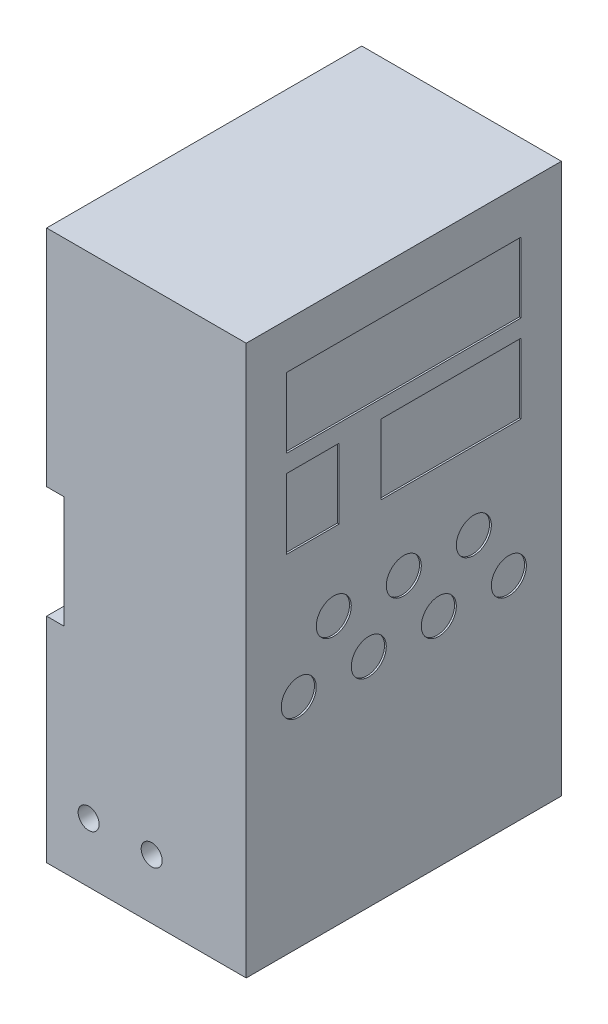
ISO-10303-21;
HEADER;
FILE_DESCRIPTION(('STEP AP214'),'2;1');
FILE_NAME('part.step','',(''),(''),'','','');
FILE_SCHEMA(('AUTOMOTIVE_DESIGN { 1 0 10303 214 1 1 1 1 }'));
ENDSEC;
DATA;
#1=APPLICATION_CONTEXT('core data for automotive mechanical design processes');
#2=APPLICATION_PROTOCOL_DEFINITION('international standard','automotive_design',2000,#1);
#3=PRODUCT_CONTEXT('',#1,'mechanical');
#4=PRODUCT('Part','Part','',(#3));
#5=PRODUCT_RELATED_PRODUCT_CATEGORY('part','',(#4));
#6=PRODUCT_DEFINITION_FORMATION('','',#4);
#7=PRODUCT_DEFINITION_CONTEXT('part definition',#1,'design');
#8=PRODUCT_DEFINITION('design','',#6,#7);
#9=PRODUCT_DEFINITION_SHAPE('','',#8);
#10=(LENGTH_UNIT() NAMED_UNIT(*) SI_UNIT(.MILLI.,.METRE.));
#11=(NAMED_UNIT(*) PLANE_ANGLE_UNIT() SI_UNIT($,.RADIAN.));
#12=(NAMED_UNIT(*) SI_UNIT($,.STERADIAN.) SOLID_ANGLE_UNIT());
#13=UNCERTAINTY_MEASURE_WITH_UNIT(LENGTH_MEASURE(1.E-05),#10,'distance_accuracy_value','');
#14=(GEOMETRIC_REPRESENTATION_CONTEXT(3) GLOBAL_UNCERTAINTY_ASSIGNED_CONTEXT((#13)) GLOBAL_UNIT_ASSIGNED_CONTEXT((#10,
#11,#12)) REPRESENTATION_CONTEXT('',''));
#15=CARTESIAN_POINT('',(0.,0.,0.));
#16=DIRECTION('',(0.,0.,1.));
#17=DIRECTION('',(1.,0.,0.));
#18=AXIS2_PLACEMENT_3D('',#15,#16,#17);
#19=CARTESIAN_POINT('',(0.,93.,90.));
#20=DIRECTION('',(0.,1.,0.));
#21=DIRECTION('',(0.,0.,1.));
#22=AXIS2_PLACEMENT_3D('',#19,#20,#21);
#23=PLANE('',#22);
#24=DIRECTION('',(1.,0.,0.));
#25=VECTOR('',#24,1.);
#26=CARTESIAN_POINT('',(0.,93.,0.));
#27=LINE('',#26,#25);
#28=CARTESIAN_POINT('',(0.,93.,0.));
#29=VERTEX_POINT('',#28);
#30=CARTESIAN_POINT('',(5.,93.,0.));
#31=VERTEX_POINT('',#30);
#32=EDGE_CURVE('E317',#29,#31,#27,.T.);
#33=ORIENTED_EDGE('',*,*,#32,.T.);
#34=DIRECTION('',(0.,0.,-1.));
#35=VECTOR('',#34,1.);
#36=CARTESIAN_POINT('',(5.,93.,90.));
#37=LINE('',#36,#35);
#38=CARTESIAN_POINT('',(5.,93.,90.));
#39=VERTEX_POINT('',#38);
#40=EDGE_CURVE('E11',#39,#31,#37,.T.);
#41=ORIENTED_EDGE('',*,*,#40,.F.);
#42=DIRECTION('',(1.,0.,0.));
#43=VECTOR('',#42,1.);
#44=CARTESIAN_POINT('',(0.,93.,90.));
#45=LINE('',#44,#43);
#46=CARTESIAN_POINT('',(0.,93.,90.));
#47=VERTEX_POINT('',#46);
#48=EDGE_CURVE('E320',#47,#39,#45,.T.);
#49=ORIENTED_EDGE('',*,*,#48,.F.);
#50=DIRECTION('',(0.,0.,-1.));
#51=VECTOR('',#50,1.);
#52=CARTESIAN_POINT('',(0.,93.,90.));
#53=LINE('',#52,#51);
#54=EDGE_CURVE('E340',#47,#29,#53,.T.);
#55=ORIENTED_EDGE('',*,*,#54,.T.);
#56=EDGE_LOOP('',(#33,#41,#49,#55));
#57=FACE_BOUND('',#56,.T.);
#58=ADVANCED_FACE('F37',(#57),#23,.F.);
#59=CARTESIAN_POINT('',(5.00000000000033,0.,90.));
#60=DIRECTION('',(1.,0.,0.));
#61=DIRECTION('',(0.,1.,0.));
#62=AXIS2_PLACEMENT_3D('',#59,#60,#61);
#63=PLANE('',#62);
#64=DIRECTION('',(0.,-1.,0.));
#65=VECTOR('',#64,1.);
#66=CARTESIAN_POINT('',(5.00000000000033,0.,0.));
#67=LINE('',#66,#65);
#68=CARTESIAN_POINT('',(5.,61.,0.));
#69=VERTEX_POINT('',#68);
#70=EDGE_CURVE('E343',#31,#69,#67,.T.);
#71=ORIENTED_EDGE('',*,*,#70,.T.);
#72=DIRECTION('',(0.,0.,-1.));
#73=VECTOR('',#72,1.);
#74=CARTESIAN_POINT('',(5.,61.,90.));
#75=LINE('',#74,#73);
#76=CARTESIAN_POINT('',(5.,61.,90.));
#77=VERTEX_POINT('',#76);
#78=EDGE_CURVE('E44',#77,#69,#75,.T.);
#79=ORIENTED_EDGE('',*,*,#78,.F.);
#80=DIRECTION('',(0.,-1.,0.));
#81=VECTOR('',#80,1.);
#82=CARTESIAN_POINT('',(5.00000000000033,0.,90.));
#83=LINE('',#82,#81);
#84=EDGE_CURVE('E323',#39,#77,#83,.T.);
#85=ORIENTED_EDGE('',*,*,#84,.F.);
#86=ORIENTED_EDGE('',*,*,#40,.T.);
#87=EDGE_LOOP('',(#71,#79,#85,#86));
#88=FACE_BOUND('',#87,.T.);
#89=ADVANCED_FACE('F379',(#88),#63,.F.);
#90=CARTESIAN_POINT('',(0.,61.,90.));
#91=DIRECTION('',(0.,1.,0.));
#92=DIRECTION('',(0.,0.,1.));
#93=AXIS2_PLACEMENT_3D('',#90,#91,#92);
#94=PLANE('',#93);
#95=DIRECTION('',(1.,0.,0.));
#96=VECTOR('',#95,1.);
#97=CARTESIAN_POINT('',(0.,61.,0.));
#98=LINE('',#97,#96);
#99=CARTESIAN_POINT('',(0.,61.,0.));
#100=VERTEX_POINT('',#99);
#101=EDGE_CURVE('E346',#100,#69,#98,.T.);
#102=ORIENTED_EDGE('',*,*,#101,.F.);
#103=DIRECTION('',(0.,0.,-1.));
#104=VECTOR('',#103,1.);
#105=CARTESIAN_POINT('',(0.,61.,90.));
#106=LINE('',#105,#104);
#107=CARTESIAN_POINT('',(0.,61.,90.));
#108=VERTEX_POINT('',#107);
#109=EDGE_CURVE('E372',#108,#100,#106,.T.);
#110=ORIENTED_EDGE('',*,*,#109,.F.);
#111=DIRECTION('',(1.,0.,0.));
#112=VECTOR('',#111,1.);
#113=CARTESIAN_POINT('',(0.,61.,90.));
#114=LINE('',#113,#112);
#115=EDGE_CURVE('E326',#108,#77,#114,.T.);
#116=ORIENTED_EDGE('',*,*,#115,.T.);
#117=ORIENTED_EDGE('',*,*,#78,.T.);
#118=EDGE_LOOP('',(#102,#110,#116,#117));
#119=FACE_BOUND('',#118,.T.);
#120=ADVANCED_FACE('F376',(#119),#94,.T.);
#121=CARTESIAN_POINT('',(0.,0.,90.));
#122=DIRECTION('',(-1.,0.,0.));
#123=DIRECTION('',(0.,0.,1.));
#124=AXIS2_PLACEMENT_3D('',#121,#122,#123);
#125=PLANE('',#124);
#126=DIRECTION('',(0.,1.,0.));
#127=VECTOR('',#126,1.);
#128=CARTESIAN_POINT('',(0.,0.,0.));
#129=LINE('',#128,#127);
#130=CARTESIAN_POINT('',(0.,0.,0.));
#131=VERTEX_POINT('',#130);
#132=EDGE_CURVE('E349',#131,#100,#129,.T.);
#133=ORIENTED_EDGE('',*,*,#132,.F.);
#134=DIRECTION('',(0.,0.,-1.));
#135=VECTOR('',#134,1.);
#136=CARTESIAN_POINT('',(0.,0.,90.));
#137=LINE('',#136,#135);
#138=CARTESIAN_POINT('',(0.,0.,90.));
#139=VERTEX_POINT('',#138);
#140=EDGE_CURVE('E370',#139,#131,#137,.T.);
#141=ORIENTED_EDGE('',*,*,#140,.F.);
#142=DIRECTION('',(0.,1.,0.));
#143=VECTOR('',#142,1.);
#144=CARTESIAN_POINT('',(0.,0.,90.));
#145=LINE('',#144,#143);
#146=EDGE_CURVE('E329',#139,#108,#145,.T.);
#147=ORIENTED_EDGE('',*,*,#146,.T.);
#148=ORIENTED_EDGE('',*,*,#109,.T.);
#149=EDGE_LOOP('',(#133,#141,#147,#148));
#150=FACE_BOUND('',#149,.T.);
#151=ADVANCED_FACE('F388',(#150),#125,.T.);
#152=CARTESIAN_POINT('',(0.,0.,90.));
#153=DIRECTION('',(0.,1.,0.));
#154=DIRECTION('',(0.,0.,1.));
#155=AXIS2_PLACEMENT_3D('',#152,#153,#154);
#156=PLANE('',#155);
#157=DIRECTION('',(1.,0.,0.));
#158=VECTOR('',#157,1.);
#159=CARTESIAN_POINT('',(0.,0.,0.));
#160=LINE('',#159,#158);
#161=CARTESIAN_POINT('',(57.,0.,0.));
#162=VERTEX_POINT('',#161);
#163=EDGE_CURVE('E352',#131,#162,#160,.T.);
#164=ORIENTED_EDGE('',*,*,#163,.T.);
#165=DIRECTION('',(0.,0.,-1.));
#166=VECTOR('',#165,1.);
#167=CARTESIAN_POINT('',(57.,0.,90.));
#168=LINE('',#167,#166);
#169=CARTESIAN_POINT('',(57.,0.,90.));
#170=VERTEX_POINT('',#169);
#171=EDGE_CURVE('E367',#170,#162,#168,.T.);
#172=ORIENTED_EDGE('',*,*,#171,.F.);
#173=DIRECTION('',(1.,0.,0.));
#174=VECTOR('',#173,1.);
#175=CARTESIAN_POINT('',(0.,0.,90.));
#176=LINE('',#175,#174);
#177=EDGE_CURVE('E332',#139,#170,#176,.T.);
#178=ORIENTED_EDGE('',*,*,#177,.F.);
#179=ORIENTED_EDGE('',*,*,#140,.T.);
#180=EDGE_LOOP('',(#164,#172,#178,#179));
#181=FACE_BOUND('',#180,.T.);
#182=ADVANCED_FACE('F411',(#181),#156,.F.);
#183=CARTESIAN_POINT('',(57.,0.,90.));
#184=DIRECTION('',(-1.,0.,0.));
#185=DIRECTION('',(0.,-1.,0.));
#186=AXIS2_PLACEMENT_3D('',#183,#184,#185);
#187=PLANE('',#186);
#188=CARTESIAN_POINT('',(57.,77.,65.));
#189=DIRECTION('',(1.,0.,0.));
#190=DIRECTION('',(0.,-1.,0.));
#191=AXIS2_PLACEMENT_3D('',#188,#189,#190);
#192=CIRCLE('',#191,5.00000000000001);
#193=CARTESIAN_POINT('',(57.,72.,65.));
#194=VERTEX_POINT('',#193);
#195=EDGE_CURVE('E199',#194,#194,#192,.T.);
#196=ORIENTED_EDGE('',*,*,#195,.F.);
#197=EDGE_LOOP('',(#196));
#198=FACE_BOUND('',#197,.T.);
#199=CARTESIAN_POINT('',(57.,77.,25.));
#200=DIRECTION('',(1.,0.,0.));
#201=DIRECTION('',(0.,1.,0.));
#202=AXIS2_PLACEMENT_3D('',#199,#200,#201);
#203=CIRCLE('',#202,5.);
#204=CARTESIAN_POINT('',(57.,82.,25.));
#205=VERTEX_POINT('',#204);
#206=EDGE_CURVE('E804',#205,#205,#203,.T.);
#207=ORIENTED_EDGE('',*,*,#206,.F.);
#208=EDGE_LOOP('',(#207));
#209=FACE_BOUND('',#208,.T.);
#210=CARTESIAN_POINT('',(57.,77.,45.));
#211=DIRECTION('',(1.,0.,0.));
#212=DIRECTION('',(0.,1.,0.));
#213=AXIS2_PLACEMENT_3D('',#210,#211,#212);
#214=CIRCLE('',#213,5.);
#215=CARTESIAN_POINT('',(57.,82.,45.));
#216=VERTEX_POINT('',#215);
#217=EDGE_CURVE('E217',#216,#216,#214,.T.);
#218=ORIENTED_EDGE('',*,*,#217,.F.);
#219=EDGE_LOOP('',(#218));
#220=FACE_BOUND('',#219,.T.);
#221=DIRECTION('',(0.,0.,1.));
#222=VECTOR('',#221,1.);
#223=CARTESIAN_POINT('',(57.,119.,11.5));
#224=LINE('',#223,#222);
#225=CARTESIAN_POINT('',(57.,119.,11.5));
#226=VERTEX_POINT('',#225);
#227=CARTESIAN_POINT('',(57.,119.,51.5));
#228=VERTEX_POINT('',#227);
#229=EDGE_CURVE('E205',#226,#228,#224,.T.);
#230=ORIENTED_EDGE('',*,*,#229,.F.);
#231=DIRECTION('',(0.,1.,0.));
#232=VECTOR('',#231,1.);
#233=CARTESIAN_POINT('',(57.,119.,11.5));
#234=LINE('',#233,#232);
#235=CARTESIAN_POINT('',(57.,99.,11.4999999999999));
#236=VERTEX_POINT('',#235);
#237=EDGE_CURVE('E51',#236,#226,#234,.T.);
#238=ORIENTED_EDGE('',*,*,#237,.F.);
#239=DIRECTION('',(0.,0.,-1.));
#240=VECTOR('',#239,1.);
#241=CARTESIAN_POINT('',(57.,99.,11.4999999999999));
#242=LINE('',#241,#240);
#243=CARTESIAN_POINT('',(57.,99.,51.5));
#244=VERTEX_POINT('',#243);
#245=EDGE_CURVE('E193',#244,#236,#242,.T.);
#246=ORIENTED_EDGE('',*,*,#245,.F.);
#247=DIRECTION('',(0.,-1.,0.));
#248=VECTOR('',#247,1.);
#249=CARTESIAN_POINT('',(57.,119.,51.5));
#250=LINE('',#249,#248);
#251=EDGE_CURVE('E196',#228,#244,#250,.T.);
#252=ORIENTED_EDGE('',*,*,#251,.F.);
#253=EDGE_LOOP('',(#230,#238,#246,#252));
#254=FACE_BOUND('',#253,.T.);
#255=CARTESIAN_POINT('',(57.,62.,35.));
#256=DIRECTION('',(1.,0.,0.));
#257=DIRECTION('',(0.,1.,0.));
#258=AXIS2_PLACEMENT_3D('',#255,#256,#257);
#259=CIRCLE('',#258,5.);
#260=CARTESIAN_POINT('',(57.,67.,35.));
#261=VERTEX_POINT('',#260);
#262=EDGE_CURVE('E224',#261,#261,#259,.T.);
#263=ORIENTED_EDGE('',*,*,#262,.F.);
#264=EDGE_LOOP('',(#263));
#265=FACE_BOUND('',#264,.T.);
#266=CARTESIAN_POINT('',(57.,62.,15.));
#267=DIRECTION('',(1.,0.,0.));
#268=DIRECTION('',(0.,1.,0.));
#269=AXIS2_PLACEMENT_3D('',#266,#267,#268);
#270=CIRCLE('',#269,5.);
#271=CARTESIAN_POINT('',(57.,67.,15.));
#272=VERTEX_POINT('',#271);
#273=EDGE_CURVE('E230',#272,#272,#270,.T.);
#274=ORIENTED_EDGE('',*,*,#273,.F.);
#275=EDGE_LOOP('',(#274));
#276=FACE_BOUND('',#275,.T.);
#277=CARTESIAN_POINT('',(57.,62.,55.));
#278=DIRECTION('',(1.,0.,0.));
#279=DIRECTION('',(0.,-1.,0.));
#280=AXIS2_PLACEMENT_3D('',#277,#278,#279);
#281=CIRCLE('',#280,5.);
#282=CARTESIAN_POINT('',(57.,57.,55.));
#283=VERTEX_POINT('',#282);
#284=EDGE_CURVE('E236',#283,#283,#281,.T.);
#285=ORIENTED_EDGE('',*,*,#284,.F.);
#286=EDGE_LOOP('',(#285));
#287=FACE_BOUND('',#286,.T.);
#288=CARTESIAN_POINT('',(57.,62.,75.));
#289=DIRECTION('',(1.,0.,0.));
#290=DIRECTION('',(0.,-1.,0.));
#291=AXIS2_PLACEMENT_3D('',#288,#289,#290);
#292=CIRCLE('',#291,5.00000000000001);
#293=CARTESIAN_POINT('',(57.,57.,75.));
#294=VERTEX_POINT('',#293);
#295=EDGE_CURVE('E242',#294,#294,#292,.T.);
#296=ORIENTED_EDGE('',*,*,#295,.F.);
#297=EDGE_LOOP('',(#296));
#298=FACE_BOUND('',#297,.T.);
#299=DIRECTION('',(0.,0.,-1.));
#300=VECTOR('',#299,1.);
#301=CARTESIAN_POINT('',(57.,99.,78.4999999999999));
#302=LINE('',#301,#300);
#303=CARTESIAN_POINT('',(57.,99.,78.4999999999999));
#304=VERTEX_POINT('',#303);
#305=CARTESIAN_POINT('',(57.,99.,63.4999999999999));
#306=VERTEX_POINT('',#305);
#307=EDGE_CURVE('E260',#304,#306,#302,.T.);
#308=ORIENTED_EDGE('',*,*,#307,.F.);
#309=DIRECTION('',(0.,-1.,0.));
#310=VECTOR('',#309,1.);
#311=CARTESIAN_POINT('',(57.,119.,78.5));
#312=LINE('',#311,#310);
#313=CARTESIAN_POINT('',(57.,119.,78.5));
#314=VERTEX_POINT('',#313);
#315=EDGE_CURVE('E59',#314,#304,#312,.T.);
#316=ORIENTED_EDGE('',*,*,#315,.F.);
#317=DIRECTION('',(0.,0.,1.));
#318=VECTOR('',#317,1.);
#319=CARTESIAN_POINT('',(57.,119.,78.5));
#320=LINE('',#319,#318);
#321=CARTESIAN_POINT('',(57.,119.,63.5));
#322=VERTEX_POINT('',#321);
#323=EDGE_CURVE('E249',#322,#314,#320,.T.);
#324=ORIENTED_EDGE('',*,*,#323,.F.);
#325=DIRECTION('',(0.,1.,0.));
#326=VECTOR('',#325,1.);
#327=CARTESIAN_POINT('',(57.,119.,63.5));
#328=LINE('',#327,#326);
#329=EDGE_CURVE('E263',#306,#322,#328,.T.);
#330=ORIENTED_EDGE('',*,*,#329,.F.);
#331=EDGE_LOOP('',(#308,#316,#324,#330));
#332=FACE_BOUND('',#331,.T.);
#333=DIRECTION('',(0.,0.,-1.));
#334=VECTOR('',#333,1.);
#335=CARTESIAN_POINT('',(57.,124.,11.4999999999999));
#336=LINE('',#335,#334);
#337=CARTESIAN_POINT('',(57.,124.,78.5));
#338=VERTEX_POINT('',#337);
#339=CARTESIAN_POINT('',(57.,124.,11.4999999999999));
#340=VERTEX_POINT('',#339);
#341=EDGE_CURVE('E291',#338,#340,#336,.T.);
#342=ORIENTED_EDGE('',*,*,#341,.F.);
#343=DIRECTION('',(0.,-1.,0.));
#344=VECTOR('',#343,1.);
#345=CARTESIAN_POINT('',(57.,144.,78.5));
#346=LINE('',#345,#344);
#347=CARTESIAN_POINT('',(57.,144.,78.5));
#348=VERTEX_POINT('',#347);
#349=EDGE_CURVE('E270',#348,#338,#346,.T.);
#350=ORIENTED_EDGE('',*,*,#349,.F.);
#351=DIRECTION('',(0.,0.,1.));
#352=VECTOR('',#351,1.);
#353=CARTESIAN_POINT('',(57.,144.,11.5));
#354=LINE('',#353,#352);
#355=CARTESIAN_POINT('',(57.,144.,11.5));
#356=VERTEX_POINT('',#355);
#357=EDGE_CURVE('E280',#356,#348,#354,.T.);
#358=ORIENTED_EDGE('',*,*,#357,.F.);
#359=DIRECTION('',(0.,1.,0.));
#360=VECTOR('',#359,1.);
#361=CARTESIAN_POINT('',(57.,144.,11.5));
#362=LINE('',#361,#360);
#363=EDGE_CURVE('E294',#340,#356,#362,.T.);
#364=ORIENTED_EDGE('',*,*,#363,.F.);
#365=EDGE_LOOP('',(#342,#350,#358,#364));
#366=FACE_BOUND('',#365,.T.);
#367=DIRECTION('',(0.,1.,0.));
#368=VECTOR('',#367,1.);
#369=CARTESIAN_POINT('',(57.,0.,0.));
#370=LINE('',#369,#368);
#371=CARTESIAN_POINT('',(57.,157.,0.));
#372=VERTEX_POINT('',#371);
#373=EDGE_CURVE('E354',#162,#372,#370,.T.);
#374=ORIENTED_EDGE('',*,*,#373,.T.);
#375=DIRECTION('',(0.,0.,-1.));
#376=VECTOR('',#375,1.);
#377=CARTESIAN_POINT('',(57.,157.,90.));
#378=LINE('',#377,#376);
#379=CARTESIAN_POINT('',(57.,157.,90.));
#380=VERTEX_POINT('',#379);
#381=EDGE_CURVE('E364',#380,#372,#378,.T.);
#382=ORIENTED_EDGE('',*,*,#381,.F.);
#383=DIRECTION('',(0.,1.,0.));
#384=VECTOR('',#383,1.);
#385=CARTESIAN_POINT('',(57.,0.,90.));
#386=LINE('',#385,#384);
#387=EDGE_CURVE('E334',#170,#380,#386,.T.);
#388=ORIENTED_EDGE('',*,*,#387,.F.);
#389=ORIENTED_EDGE('',*,*,#171,.T.);
#390=EDGE_LOOP('',(#374,#382,#388,#389));
#391=FACE_BOUND('',#390,.T.);
#392=ADVANCED_FACE('F408',(#198,#209,#220,#254,#265,#276,#287,#298,#332,#366,#391),#187,.F.);
#393=CARTESIAN_POINT('',(0.,157.,90.));
#394=DIRECTION('',(0.,-1.,0.));
#395=DIRECTION('',(0.,0.,-1.));
#396=AXIS2_PLACEMENT_3D('',#393,#394,#395);
#397=PLANE('',#396);
#398=DIRECTION('',(-1.,0.,0.));
#399=VECTOR('',#398,1.);
#400=CARTESIAN_POINT('',(0.,157.,0.));
#401=LINE('',#400,#399);
#402=CARTESIAN_POINT('',(0.,157.,0.));
#403=VERTEX_POINT('',#402);
#404=EDGE_CURVE('E356',#372,#403,#401,.T.);
#405=ORIENTED_EDGE('',*,*,#404,.T.);
#406=DIRECTION('',(0.,0.,-1.));
#407=VECTOR('',#406,1.);
#408=CARTESIAN_POINT('',(0.,157.,90.));
#409=LINE('',#408,#407);
#410=CARTESIAN_POINT('',(0.,157.,90.));
#411=VERTEX_POINT('',#410);
#412=EDGE_CURVE('E361',#411,#403,#409,.T.);
#413=ORIENTED_EDGE('',*,*,#412,.F.);
#414=DIRECTION('',(-1.,0.,0.));
#415=VECTOR('',#414,1.);
#416=CARTESIAN_POINT('',(0.,157.,90.));
#417=LINE('',#416,#415);
#418=EDGE_CURVE('E336',#380,#411,#417,.T.);
#419=ORIENTED_EDGE('',*,*,#418,.F.);
#420=ORIENTED_EDGE('',*,*,#381,.T.);
#421=EDGE_LOOP('',(#405,#413,#419,#420));
#422=FACE_BOUND('',#421,.T.);
#423=ADVANCED_FACE('F404',(#422),#397,.F.);
#424=CARTESIAN_POINT('',(0.,0.,90.));
#425=DIRECTION('',(1.,0.,0.));
#426=DIRECTION('',(0.,1.,0.));
#427=AXIS2_PLACEMENT_3D('',#424,#425,#426);
#428=PLANE('',#427);
#429=DIRECTION('',(0.,-1.,0.));
#430=VECTOR('',#429,1.);
#431=CARTESIAN_POINT('',(0.,0.,0.));
#432=LINE('',#431,#430);
#433=EDGE_CURVE('E324',#403,#29,#432,.T.);
#434=ORIENTED_EDGE('',*,*,#433,.T.);
#435=ORIENTED_EDGE('',*,*,#54,.F.);
#436=DIRECTION('',(0.,-1.,0.));
#437=VECTOR('',#436,1.);
#438=CARTESIAN_POINT('',(0.,0.,90.));
#439=LINE('',#438,#437);
#440=EDGE_CURVE('E338',#411,#47,#439,.T.);
#441=ORIENTED_EDGE('',*,*,#440,.F.);
#442=ORIENTED_EDGE('',*,*,#412,.T.);
#443=EDGE_LOOP('',(#434,#435,#441,#442));
#444=FACE_BOUND('',#443,.T.);
#445=ADVANCED_FACE('F400',(#444),#428,.F.);
#446=CARTESIAN_POINT('',(0.,0.,90.));
#447=DIRECTION('',(0.,0.,1.));
#448=DIRECTION('',(1.,0.,0.));
#449=AXIS2_PLACEMENT_3D('',#446,#447,#448);
#450=PLANE('',#449);
#451=CARTESIAN_POINT('',(30.,17.,90.));
#452=DIRECTION('',(0.,0.,1.));
#453=DIRECTION('',(1.,0.,0.));
#454=AXIS2_PLACEMENT_3D('',#451,#452,#453);
#455=CIRCLE('',#454,3.);
#456=CARTESIAN_POINT('',(33.,17.,90.));
#457=VERTEX_POINT('',#456);
#458=EDGE_CURVE('E301',#457,#457,#455,.T.);
#459=ORIENTED_EDGE('',*,*,#458,.F.);
#460=EDGE_LOOP('',(#459));
#461=FACE_BOUND('',#460,.T.);
#462=CARTESIAN_POINT('',(12.,17.,90.));
#463=DIRECTION('',(0.,0.,1.));
#464=DIRECTION('',(1.,0.,0.));
#465=AXIS2_PLACEMENT_3D('',#462,#463,#464);
#466=CIRCLE('',#465,3.);
#467=CARTESIAN_POINT('',(15.,17.,90.));
#468=VERTEX_POINT('',#467);
#469=EDGE_CURVE('E311',#468,#468,#466,.T.);
#470=ORIENTED_EDGE('',*,*,#469,.F.);
#471=EDGE_LOOP('',(#470));
#472=FACE_BOUND('',#471,.T.);
#473=ORIENTED_EDGE('',*,*,#48,.T.);
#474=ORIENTED_EDGE('',*,*,#84,.T.);
#475=ORIENTED_EDGE('',*,*,#115,.F.);
#476=ORIENTED_EDGE('',*,*,#146,.F.);
#477=ORIENTED_EDGE('',*,*,#177,.T.);
#478=ORIENTED_EDGE('',*,*,#387,.T.);
#479=ORIENTED_EDGE('',*,*,#418,.T.);
#480=ORIENTED_EDGE('',*,*,#440,.T.);
#481=EDGE_LOOP('',(#473,#474,#475,#476,#477,#478,#479,#480));
#482=FACE_BOUND('',#481,.T.);
#483=ADVANCED_FACE('F392',(#461,#472,#482),#450,.T.);
#484=CARTESIAN_POINT('',(0.,0.,0.));
#485=DIRECTION('',(0.,0.,1.));
#486=DIRECTION('',(1.,0.,0.));
#487=AXIS2_PLACEMENT_3D('',#484,#485,#486);
#488=PLANE('',#487);
#489=ORIENTED_EDGE('',*,*,#32,.F.);
#490=ORIENTED_EDGE('',*,*,#433,.F.);
#491=ORIENTED_EDGE('',*,*,#404,.F.);
#492=ORIENTED_EDGE('',*,*,#373,.F.);
#493=ORIENTED_EDGE('',*,*,#163,.F.);
#494=ORIENTED_EDGE('',*,*,#132,.T.);
#495=ORIENTED_EDGE('',*,*,#101,.T.);
#496=ORIENTED_EDGE('',*,*,#70,.F.);
#497=EDGE_LOOP('',(#489,#490,#491,#492,#493,#494,#495,#496));
#498=FACE_BOUND('',#497,.T.);
#499=ADVANCED_FACE('F383',(#498),#488,.F.);
#500=CARTESIAN_POINT('',(12.,17.,20.));
#501=DIRECTION('',(0.,0.,1.));
#502=DIRECTION('',(1.,0.,0.));
#503=AXIS2_PLACEMENT_3D('',#500,#501,#502);
#504=CYLINDRICAL_SURFACE('',#503,3.);
#505=CARTESIAN_POINT('',(12.,17.,20.));
#506=DIRECTION('',(0.,0.,1.));
#507=DIRECTION('',(1.,0.,0.));
#508=AXIS2_PLACEMENT_3D('',#505,#506,#507);
#509=CIRCLE('',#508,3.);
#510=CARTESIAN_POINT('',(15.,17.,20.));
#511=VERTEX_POINT('',#510);
#512=EDGE_CURVE('E314',#511,#511,#509,.T.);
#513=ORIENTED_EDGE('',*,*,#512,.F.);
#514=EDGE_LOOP('',(#513));
#515=FACE_BOUND('',#514,.T.);
#516=ORIENTED_EDGE('',*,*,#469,.T.);
#517=EDGE_LOOP('',(#516));
#518=FACE_BOUND('',#517,.T.);
#519=ADVANCED_FACE('F468',(#515,#518),#504,.F.);
#520=CARTESIAN_POINT('',(12.,17.,20.));
#521=DIRECTION('',(0.,0.,1.));
#522=DIRECTION('',(1.,0.,0.));
#523=AXIS2_PLACEMENT_3D('',#520,#521,#522);
#524=PLANE('',#523);
#525=ORIENTED_EDGE('',*,*,#512,.T.);
#526=EDGE_LOOP('',(#525));
#527=FACE_BOUND('',#526,.T.);
#528=ADVANCED_FACE('F482',(#527),#524,.T.);
#529=CARTESIAN_POINT('',(30.,17.,20.));
#530=DIRECTION('',(0.,0.,1.));
#531=DIRECTION('',(1.,0.,0.));
#532=AXIS2_PLACEMENT_3D('',#529,#530,#531);
#533=CYLINDRICAL_SURFACE('',#532,3.);
#534=CARTESIAN_POINT('',(30.,17.,20.));
#535=DIRECTION('',(0.,0.,1.));
#536=DIRECTION('',(1.,0.,0.));
#537=AXIS2_PLACEMENT_3D('',#534,#535,#536);
#538=CIRCLE('',#537,3.);
#539=CARTESIAN_POINT('',(33.,17.,20.));
#540=VERTEX_POINT('',#539);
#541=EDGE_CURVE('E308',#540,#540,#538,.T.);
#542=ORIENTED_EDGE('',*,*,#541,.F.);
#543=EDGE_LOOP('',(#542));
#544=FACE_BOUND('',#543,.T.);
#545=ORIENTED_EDGE('',*,*,#458,.T.);
#546=EDGE_LOOP('',(#545));
#547=FACE_BOUND('',#546,.T.);
#548=ADVANCED_FACE('F492',(#544,#547),#533,.F.);
#549=CARTESIAN_POINT('',(30.,17.,20.));
#550=DIRECTION('',(0.,0.,1.));
#551=DIRECTION('',(1.,0.,0.));
#552=AXIS2_PLACEMENT_3D('',#549,#550,#551);
#553=PLANE('',#552);
#554=ORIENTED_EDGE('',*,*,#541,.T.);
#555=EDGE_LOOP('',(#554));
#556=FACE_BOUND('',#555,.T.);
#557=ADVANCED_FACE('F502',(#556),#553,.T.);
#558=CARTESIAN_POINT('',(56.5,144.,78.5));
#559=DIRECTION('',(0.,0.,1.));
#560=DIRECTION('',(1.,0.,0.));
#561=AXIS2_PLACEMENT_3D('',#558,#559,#560);
#562=PLANE('',#561);
#563=ORIENTED_EDGE('',*,*,#349,.T.);
#564=DIRECTION('',(1.,0.,0.));
#565=VECTOR('',#564,1.);
#566=CARTESIAN_POINT('',(56.5,124.,78.5));
#567=LINE('',#566,#565);
#568=CARTESIAN_POINT('',(56.5,124.,78.5));
#569=VERTEX_POINT('',#568);
#570=EDGE_CURVE('E289',#569,#338,#567,.T.);
#571=ORIENTED_EDGE('',*,*,#570,.F.);
#572=DIRECTION('',(0.,-1.,0.));
#573=VECTOR('',#572,1.);
#574=CARTESIAN_POINT('',(56.5,144.,78.5));
#575=LINE('',#574,#573);
#576=CARTESIAN_POINT('',(56.5,144.,78.5));
#577=VERTEX_POINT('',#576);
#578=EDGE_CURVE('E276',#577,#569,#575,.T.);
#579=ORIENTED_EDGE('',*,*,#578,.F.);
#580=DIRECTION('',(1.,0.,0.));
#581=VECTOR('',#580,1.);
#582=CARTESIAN_POINT('',(56.5,144.,78.5));
#583=LINE('',#582,#581);
#584=EDGE_CURVE('E299',#577,#348,#583,.T.);
#585=ORIENTED_EDGE('',*,*,#584,.T.);
#586=EDGE_LOOP('',(#563,#571,#579,#585));
#587=FACE_BOUND('',#586,.T.);
#588=ADVANCED_FACE('F512',(#587),#562,.F.);
#589=CARTESIAN_POINT('',(56.5,144.,11.5));
#590=DIRECTION('',(0.,1.,0.));
#591=DIRECTION('',(-1.,0.,0.));
#592=AXIS2_PLACEMENT_3D('',#589,#590,#591);
#593=PLANE('',#592);
#594=ORIENTED_EDGE('',*,*,#357,.T.);
#595=ORIENTED_EDGE('',*,*,#584,.F.);
#596=DIRECTION('',(0.,0.,1.));
#597=VECTOR('',#596,1.);
#598=CARTESIAN_POINT('',(56.5,144.,11.5));
#599=LINE('',#598,#597);
#600=CARTESIAN_POINT('',(56.5,144.,11.5));
#601=VERTEX_POINT('',#600);
#602=EDGE_CURVE('E286',#601,#577,#599,.T.);
#603=ORIENTED_EDGE('',*,*,#602,.F.);
#604=DIRECTION('',(1.,0.,0.));
#605=VECTOR('',#604,1.);
#606=CARTESIAN_POINT('',(56.5,144.,11.5));
#607=LINE('',#606,#605);
#608=EDGE_CURVE('E302',#601,#356,#607,.T.);
#609=ORIENTED_EDGE('',*,*,#608,.T.);
#610=EDGE_LOOP('',(#594,#595,#603,#609));
#611=FACE_BOUND('',#610,.T.);
#612=ADVANCED_FACE('F522',(#611),#593,.F.);
#613=CARTESIAN_POINT('',(56.5,144.,11.5));
#614=DIRECTION('',(0.,0.,-1.));
#615=DIRECTION('',(0.,1.,0.));
#616=AXIS2_PLACEMENT_3D('',#613,#614,#615);
#617=PLANE('',#616);
#618=ORIENTED_EDGE('',*,*,#363,.T.);
#619=ORIENTED_EDGE('',*,*,#608,.F.);
#620=DIRECTION('',(0.,1.,0.));
#621=VECTOR('',#620,1.);
#622=CARTESIAN_POINT('',(56.5,144.,11.5));
#623=LINE('',#622,#621);
#624=CARTESIAN_POINT('',(56.5,124.,11.4999999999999));
#625=VERTEX_POINT('',#624);
#626=EDGE_CURVE('E283',#625,#601,#623,.T.);
#627=ORIENTED_EDGE('',*,*,#626,.F.);
#628=DIRECTION('',(1.,0.,0.));
#629=VECTOR('',#628,1.);
#630=CARTESIAN_POINT('',(56.5,124.,11.4999999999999));
#631=LINE('',#630,#629);
#632=EDGE_CURVE('E304',#625,#340,#631,.T.);
#633=ORIENTED_EDGE('',*,*,#632,.T.);
#634=EDGE_LOOP('',(#618,#619,#627,#633));
#635=FACE_BOUND('',#634,.T.);
#636=ADVANCED_FACE('F532',(#635),#617,.F.);
#637=CARTESIAN_POINT('',(56.5,124.,11.4999999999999));
#638=DIRECTION('',(0.,-1.,0.));
#639=DIRECTION('',(1.,0.,0.));
#640=AXIS2_PLACEMENT_3D('',#637,#638,#639);
#641=PLANE('',#640);
#642=ORIENTED_EDGE('',*,*,#341,.T.);
#643=ORIENTED_EDGE('',*,*,#632,.F.);
#644=DIRECTION('',(0.,0.,-1.));
#645=VECTOR('',#644,1.);
#646=CARTESIAN_POINT('',(56.5,124.,11.4999999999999));
#647=LINE('',#646,#645);
#648=EDGE_CURVE('E279',#569,#625,#647,.T.);
#649=ORIENTED_EDGE('',*,*,#648,.F.);
#650=ORIENTED_EDGE('',*,*,#570,.T.);
#651=EDGE_LOOP('',(#642,#643,#649,#650));
#652=FACE_BOUND('',#651,.T.);
#653=ADVANCED_FACE('F542',(#652),#641,.F.);
#654=CARTESIAN_POINT('',(56.5,0.,0.));
#655=DIRECTION('',(-1.,0.,0.));
#656=DIRECTION('',(0.,0.,1.));
#657=AXIS2_PLACEMENT_3D('',#654,#655,#656);
#658=PLANE('',#657);
#659=ORIENTED_EDGE('',*,*,#578,.T.);
#660=ORIENTED_EDGE('',*,*,#648,.T.);
#661=ORIENTED_EDGE('',*,*,#626,.T.);
#662=ORIENTED_EDGE('',*,*,#602,.T.);
#663=EDGE_LOOP('',(#659,#660,#661,#662));
#664=FACE_BOUND('',#663,.T.);
#665=ADVANCED_FACE('F552',(#664),#658,.F.);
#666=CARTESIAN_POINT('',(56.5,119.,78.5));
#667=DIRECTION('',(0.,0.,1.));
#668=DIRECTION('',(0.,-1.,0.));
#669=AXIS2_PLACEMENT_3D('',#666,#667,#668);
#670=PLANE('',#669);
#671=ORIENTED_EDGE('',*,*,#315,.T.);
#672=DIRECTION('',(1.,0.,0.));
#673=VECTOR('',#672,1.);
#674=CARTESIAN_POINT('',(56.5,99.,78.4999999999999));
#675=LINE('',#674,#673);
#676=CARTESIAN_POINT('',(56.5,99.,78.4999999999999));
#677=VERTEX_POINT('',#676);
#678=EDGE_CURVE('E258',#677,#304,#675,.T.);
#679=ORIENTED_EDGE('',*,*,#678,.F.);
#680=DIRECTION('',(0.,-1.,0.));
#681=VECTOR('',#680,1.);
#682=CARTESIAN_POINT('',(56.5,119.,78.5));
#683=LINE('',#682,#681);
#684=CARTESIAN_POINT('',(56.5,119.,78.5));
#685=VERTEX_POINT('',#684);
#686=EDGE_CURVE('E245',#685,#677,#683,.T.);
#687=ORIENTED_EDGE('',*,*,#686,.F.);
#688=DIRECTION('',(1.,0.,0.));
#689=VECTOR('',#688,1.);
#690=CARTESIAN_POINT('',(56.5,119.,78.5));
#691=LINE('',#690,#689);
#692=EDGE_CURVE('E268',#685,#314,#691,.T.);
#693=ORIENTED_EDGE('',*,*,#692,.T.);
#694=EDGE_LOOP('',(#671,#679,#687,#693));
#695=FACE_BOUND('',#694,.T.);
#696=ADVANCED_FACE('F561',(#695),#670,.F.);
#697=CARTESIAN_POINT('',(56.5,119.,78.5));
#698=DIRECTION('',(0.,1.,0.));
#699=DIRECTION('',(-1.,0.,0.));
#700=AXIS2_PLACEMENT_3D('',#697,#698,#699);
#701=PLANE('',#700);
#702=ORIENTED_EDGE('',*,*,#323,.T.);
#703=ORIENTED_EDGE('',*,*,#692,.F.);
#704=DIRECTION('',(0.,0.,1.));
#705=VECTOR('',#704,1.);
#706=CARTESIAN_POINT('',(56.5,119.,78.5));
#707=LINE('',#706,#705);
#708=CARTESIAN_POINT('',(56.5,119.,63.5));
#709=VERTEX_POINT('',#708);
#710=EDGE_CURVE('E255',#709,#685,#707,.T.);
#711=ORIENTED_EDGE('',*,*,#710,.F.);
#712=DIRECTION('',(1.,0.,0.));
#713=VECTOR('',#712,1.);
#714=CARTESIAN_POINT('',(56.5,119.,63.5));
#715=LINE('',#714,#713);
#716=EDGE_CURVE('E271',#709,#322,#715,.T.);
#717=ORIENTED_EDGE('',*,*,#716,.T.);
#718=EDGE_LOOP('',(#702,#703,#711,#717));
#719=FACE_BOUND('',#718,.T.);
#720=ADVANCED_FACE('F574',(#719),#701,.F.);
#721=CARTESIAN_POINT('',(56.5,119.,63.5));
#722=DIRECTION('',(0.,0.,-1.));
#723=DIRECTION('',(0.,1.,0.));
#724=AXIS2_PLACEMENT_3D('',#721,#722,#723);
#725=PLANE('',#724);
#726=ORIENTED_EDGE('',*,*,#329,.T.);
#727=ORIENTED_EDGE('',*,*,#716,.F.);
#728=DIRECTION('',(0.,1.,0.));
#729=VECTOR('',#728,1.);
#730=CARTESIAN_POINT('',(56.5,119.,63.5));
#731=LINE('',#730,#729);
#732=CARTESIAN_POINT('',(56.5,99.,63.4999999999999));
#733=VERTEX_POINT('',#732);
#734=EDGE_CURVE('E252',#733,#709,#731,.T.);
#735=ORIENTED_EDGE('',*,*,#734,.F.);
#736=DIRECTION('',(1.,0.,0.));
#737=VECTOR('',#736,1.);
#738=CARTESIAN_POINT('',(56.5,99.,63.4999999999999));
#739=LINE('',#738,#737);
#740=EDGE_CURVE('E273',#733,#306,#739,.T.);
#741=ORIENTED_EDGE('',*,*,#740,.T.);
#742=EDGE_LOOP('',(#726,#727,#735,#741));
#743=FACE_BOUND('',#742,.T.);
#744=ADVANCED_FACE('F583',(#743),#725,.F.);
#745=CARTESIAN_POINT('',(56.5,99.,78.4999999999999));
#746=DIRECTION('',(0.,-1.,0.));
#747=DIRECTION('',(1.,0.,0.));
#748=AXIS2_PLACEMENT_3D('',#745,#746,#747);
#749=PLANE('',#748);
#750=ORIENTED_EDGE('',*,*,#307,.T.);
#751=ORIENTED_EDGE('',*,*,#740,.F.);
#752=DIRECTION('',(0.,0.,-1.));
#753=VECTOR('',#752,1.);
#754=CARTESIAN_POINT('',(56.5,99.,78.4999999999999));
#755=LINE('',#754,#753);
#756=EDGE_CURVE('E248',#677,#733,#755,.T.);
#757=ORIENTED_EDGE('',*,*,#756,.F.);
#758=ORIENTED_EDGE('',*,*,#678,.T.);
#759=EDGE_LOOP('',(#750,#751,#757,#758));
#760=FACE_BOUND('',#759,.T.);
#761=ADVANCED_FACE('F593',(#760),#749,.F.);
#762=CARTESIAN_POINT('',(56.5,0.,0.));
#763=DIRECTION('',(1.,0.,0.));
#764=DIRECTION('',(0.,0.,-1.));
#765=AXIS2_PLACEMENT_3D('',#762,#763,#764);
#766=PLANE('',#765);
#767=ORIENTED_EDGE('',*,*,#686,.T.);
#768=ORIENTED_EDGE('',*,*,#756,.T.);
#769=ORIENTED_EDGE('',*,*,#734,.T.);
#770=ORIENTED_EDGE('',*,*,#710,.T.);
#771=EDGE_LOOP('',(#767,#768,#769,#770));
#772=FACE_BOUND('',#771,.T.);
#773=ADVANCED_FACE('F603',(#772),#766,.T.);
#774=CARTESIAN_POINT('',(56.5,62.,75.));
#775=DIRECTION('',(1.,0.,0.));
#776=DIRECTION('',(0.,1.,0.));
#777=AXIS2_PLACEMENT_3D('',#774,#775,#776);
#778=CYLINDRICAL_SURFACE('',#777,5.00000000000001);
#779=CARTESIAN_POINT('',(56.5,62.,75.));
#780=DIRECTION('',(1.,0.,0.));
#781=DIRECTION('',(0.,-1.,0.));
#782=AXIS2_PLACEMENT_3D('',#779,#780,#781);
#783=CIRCLE('',#782,5.00000000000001);
#784=CARTESIAN_POINT('',(56.5,57.,75.));
#785=VERTEX_POINT('',#784);
#786=EDGE_CURVE('E239',#785,#785,#783,.T.);
#787=ORIENTED_EDGE('',*,*,#786,.F.);
#788=EDGE_LOOP('',(#787));
#789=FACE_BOUND('',#788,.T.);
#790=ORIENTED_EDGE('',*,*,#295,.T.);
#791=EDGE_LOOP('',(#790));
#792=FACE_BOUND('',#791,.T.);
#793=ADVANCED_FACE('F613',(#789,#792),#778,.F.);
#794=CARTESIAN_POINT('',(56.5,62.,75.));
#795=DIRECTION('',(-1.,0.,0.));
#796=DIRECTION('',(0.,-1.,0.));
#797=AXIS2_PLACEMENT_3D('',#794,#795,#796);
#798=PLANE('',#797);
#799=ORIENTED_EDGE('',*,*,#786,.T.);
#800=EDGE_LOOP('',(#799));
#801=FACE_BOUND('',#800,.T.);
#802=ADVANCED_FACE('F623',(#801),#798,.F.);
#803=CARTESIAN_POINT('',(56.5,62.,55.));
#804=DIRECTION('',(1.,0.,0.));
#805=DIRECTION('',(0.,1.,0.));
#806=AXIS2_PLACEMENT_3D('',#803,#804,#805);
#807=CYLINDRICAL_SURFACE('',#806,5.);
#808=CARTESIAN_POINT('',(56.5,62.,55.));
#809=DIRECTION('',(1.,0.,0.));
#810=DIRECTION('',(0.,-1.,0.));
#811=AXIS2_PLACEMENT_3D('',#808,#809,#810);
#812=CIRCLE('',#811,5.);
#813=CARTESIAN_POINT('',(56.5,57.,55.));
#814=VERTEX_POINT('',#813);
#815=EDGE_CURVE('E233',#814,#814,#812,.T.);
#816=ORIENTED_EDGE('',*,*,#815,.F.);
#817=EDGE_LOOP('',(#816));
#818=FACE_BOUND('',#817,.T.);
#819=ORIENTED_EDGE('',*,*,#284,.T.);
#820=EDGE_LOOP('',(#819));
#821=FACE_BOUND('',#820,.T.);
#822=ADVANCED_FACE('F633',(#818,#821),#807,.F.);
#823=CARTESIAN_POINT('',(56.5,62.,55.));
#824=DIRECTION('',(-1.,0.,0.));
#825=DIRECTION('',(0.,-1.,0.));
#826=AXIS2_PLACEMENT_3D('',#823,#824,#825);
#827=PLANE('',#826);
#828=ORIENTED_EDGE('',*,*,#815,.T.);
#829=EDGE_LOOP('',(#828));
#830=FACE_BOUND('',#829,.T.);
#831=ADVANCED_FACE('F643',(#830),#827,.F.);
#832=CARTESIAN_POINT('',(56.5,62.,15.));
#833=DIRECTION('',(1.,0.,0.));
#834=DIRECTION('',(0.,1.,0.));
#835=AXIS2_PLACEMENT_3D('',#832,#833,#834);
#836=CYLINDRICAL_SURFACE('',#835,5.);
#837=CARTESIAN_POINT('',(56.5,62.,15.));
#838=DIRECTION('',(1.,0.,0.));
#839=DIRECTION('',(0.,1.,0.));
#840=AXIS2_PLACEMENT_3D('',#837,#838,#839);
#841=CIRCLE('',#840,5.);
#842=CARTESIAN_POINT('',(56.5,67.,15.));
#843=VERTEX_POINT('',#842);
#844=EDGE_CURVE('E227',#843,#843,#841,.T.);
#845=ORIENTED_EDGE('',*,*,#844,.F.);
#846=EDGE_LOOP('',(#845));
#847=FACE_BOUND('',#846,.T.);
#848=ORIENTED_EDGE('',*,*,#273,.T.);
#849=EDGE_LOOP('',(#848));
#850=FACE_BOUND('',#849,.T.);
#851=ADVANCED_FACE('F653',(#847,#850),#836,.F.);
#852=CARTESIAN_POINT('',(56.5,62.,15.));
#853=DIRECTION('',(1.,0.,0.));
#854=DIRECTION('',(0.,1.,0.));
#855=AXIS2_PLACEMENT_3D('',#852,#853,#854);
#856=PLANE('',#855);
#857=ORIENTED_EDGE('',*,*,#844,.T.);
#858=EDGE_LOOP('',(#857));
#859=FACE_BOUND('',#858,.T.);
#860=ADVANCED_FACE('F663',(#859),#856,.T.);
#861=CARTESIAN_POINT('',(56.5,62.,35.));
#862=DIRECTION('',(1.,0.,0.));
#863=DIRECTION('',(0.,1.,0.));
#864=AXIS2_PLACEMENT_3D('',#861,#862,#863);
#865=CYLINDRICAL_SURFACE('',#864,5.);
#866=CARTESIAN_POINT('',(56.5,62.,35.));
#867=DIRECTION('',(1.,0.,0.));
#868=DIRECTION('',(0.,1.,0.));
#869=AXIS2_PLACEMENT_3D('',#866,#867,#868);
#870=CIRCLE('',#869,5.);
#871=CARTESIAN_POINT('',(56.5,67.,35.));
#872=VERTEX_POINT('',#871);
#873=EDGE_CURVE('E221',#872,#872,#870,.T.);
#874=ORIENTED_EDGE('',*,*,#873,.F.);
#875=EDGE_LOOP('',(#874));
#876=FACE_BOUND('',#875,.T.);
#877=ORIENTED_EDGE('',*,*,#262,.T.);
#878=EDGE_LOOP('',(#877));
#879=FACE_BOUND('',#878,.T.);
#880=ADVANCED_FACE('F673',(#876,#879),#865,.F.);
#881=CARTESIAN_POINT('',(56.5,62.,35.));
#882=DIRECTION('',(1.,0.,0.));
#883=DIRECTION('',(0.,1.,0.));
#884=AXIS2_PLACEMENT_3D('',#881,#882,#883);
#885=PLANE('',#884);
#886=ORIENTED_EDGE('',*,*,#873,.T.);
#887=EDGE_LOOP('',(#886));
#888=FACE_BOUND('',#887,.T.);
#889=ADVANCED_FACE('F683',(#888),#885,.T.);
#890=CARTESIAN_POINT('',(56.5,119.,11.5));
#891=DIRECTION('',(0.,0.,-1.));
#892=DIRECTION('',(0.,1.,0.));
#893=AXIS2_PLACEMENT_3D('',#890,#891,#892);
#894=PLANE('',#893);
#895=ORIENTED_EDGE('',*,*,#237,.T.);
#896=DIRECTION('',(1.,0.,0.));
#897=VECTOR('',#896,1.);
#898=CARTESIAN_POINT('',(56.5,119.,11.5));
#899=LINE('',#898,#897);
#900=CARTESIAN_POINT('',(56.5,119.,11.5));
#901=VERTEX_POINT('',#900);
#902=EDGE_CURVE('E171',#901,#226,#899,.T.);
#903=ORIENTED_EDGE('',*,*,#902,.F.);
#904=DIRECTION('',(0.,1.,0.));
#905=VECTOR('',#904,1.);
#906=CARTESIAN_POINT('',(56.5,119.,11.5));
#907=LINE('',#906,#905);
#908=CARTESIAN_POINT('',(56.5,99.,11.4999999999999));
#909=VERTEX_POINT('',#908);
#910=EDGE_CURVE('E175',#909,#901,#907,.T.);
#911=ORIENTED_EDGE('',*,*,#910,.F.);
#912=DIRECTION('',(1.,0.,0.));
#913=VECTOR('',#912,1.);
#914=CARTESIAN_POINT('',(56.5,99.,11.4999999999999));
#915=LINE('',#914,#913);
#916=EDGE_CURVE('E210',#909,#236,#915,.T.);
#917=ORIENTED_EDGE('',*,*,#916,.T.);
#918=EDGE_LOOP('',(#895,#903,#911,#917));
#919=FACE_BOUND('',#918,.T.);
#920=ADVANCED_FACE('F173',(#919),#894,.F.);
#921=CARTESIAN_POINT('',(56.5,99.,11.4999999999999));
#922=DIRECTION('',(0.,-1.,0.));
#923=DIRECTION('',(0.,0.,-1.));
#924=AXIS2_PLACEMENT_3D('',#921,#922,#923);
#925=PLANE('',#924);
#926=ORIENTED_EDGE('',*,*,#245,.T.);
#927=ORIENTED_EDGE('',*,*,#916,.F.);
#928=DIRECTION('',(0.,0.,-1.));
#929=VECTOR('',#928,1.);
#930=CARTESIAN_POINT('',(56.5,99.,11.4999999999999));
#931=LINE('',#930,#929);
#932=CARTESIAN_POINT('',(56.5,99.,51.5));
#933=VERTEX_POINT('',#932);
#934=EDGE_CURVE('E181',#933,#909,#931,.T.);
#935=ORIENTED_EDGE('',*,*,#934,.F.);
#936=DIRECTION('',(1.,0.,0.));
#937=VECTOR('',#936,1.);
#938=CARTESIAN_POINT('',(56.5,99.,51.5));
#939=LINE('',#938,#937);
#940=EDGE_CURVE('E212',#933,#244,#939,.T.);
#941=ORIENTED_EDGE('',*,*,#940,.T.);
#942=EDGE_LOOP('',(#926,#927,#935,#941));
#943=FACE_BOUND('',#942,.T.);
#944=ADVANCED_FACE('F702',(#943),#925,.F.);
#945=CARTESIAN_POINT('',(56.5,119.,51.5));
#946=DIRECTION('',(0.,0.,1.));
#947=DIRECTION('',(1.,0.,0.));
#948=AXIS2_PLACEMENT_3D('',#945,#946,#947);
#949=PLANE('',#948);
#950=ORIENTED_EDGE('',*,*,#251,.T.);
#951=ORIENTED_EDGE('',*,*,#940,.F.);
#952=DIRECTION('',(0.,-1.,0.));
#953=VECTOR('',#952,1.);
#954=CARTESIAN_POINT('',(56.5,119.,51.5));
#955=LINE('',#954,#953);
#956=CARTESIAN_POINT('',(56.5,119.,51.5));
#957=VERTEX_POINT('',#956);
#958=EDGE_CURVE('E189',#957,#933,#955,.T.);
#959=ORIENTED_EDGE('',*,*,#958,.F.);
#960=DIRECTION('',(1.,0.,0.));
#961=VECTOR('',#960,1.);
#962=CARTESIAN_POINT('',(56.5,119.,51.5));
#963=LINE('',#962,#961);
#964=EDGE_CURVE('E180',#957,#228,#963,.T.);
#965=ORIENTED_EDGE('',*,*,#964,.T.);
#966=EDGE_LOOP('',(#950,#951,#959,#965));
#967=FACE_BOUND('',#966,.T.);
#968=ADVANCED_FACE('F711',(#967),#949,.F.);
#969=CARTESIAN_POINT('',(56.5,119.,11.5));
#970=DIRECTION('',(0.,1.,0.));
#971=DIRECTION('',(-1.,0.,0.));
#972=AXIS2_PLACEMENT_3D('',#969,#970,#971);
#973=PLANE('',#972);
#974=ORIENTED_EDGE('',*,*,#229,.T.);
#975=ORIENTED_EDGE('',*,*,#964,.F.);
#976=DIRECTION('',(0.,0.,1.));
#977=VECTOR('',#976,1.);
#978=CARTESIAN_POINT('',(56.5,119.,11.5));
#979=LINE('',#978,#977);
#980=EDGE_CURVE('E184',#901,#957,#979,.T.);
#981=ORIENTED_EDGE('',*,*,#980,.F.);
#982=ORIENTED_EDGE('',*,*,#902,.T.);
#983=EDGE_LOOP('',(#974,#975,#981,#982));
#984=FACE_BOUND('',#983,.T.);
#985=ADVANCED_FACE('F185',(#984),#973,.F.);
#986=CARTESIAN_POINT('',(56.5,0.,0.));
#987=DIRECTION('',(-1.,0.,0.));
#988=DIRECTION('',(0.,0.,1.));
#989=AXIS2_PLACEMENT_3D('',#986,#987,#988);
#990=PLANE('',#989);
#991=ORIENTED_EDGE('',*,*,#910,.T.);
#992=ORIENTED_EDGE('',*,*,#980,.T.);
#993=ORIENTED_EDGE('',*,*,#958,.T.);
#994=ORIENTED_EDGE('',*,*,#934,.T.);
#995=EDGE_LOOP('',(#991,#992,#993,#994));
#996=FACE_BOUND('',#995,.T.);
#997=ADVANCED_FACE('F191',(#996),#990,.F.);
#998=CARTESIAN_POINT('',(56.5,77.,45.));
#999=DIRECTION('',(1.,0.,0.));
#1000=DIRECTION('',(0.,1.,0.));
#1001=AXIS2_PLACEMENT_3D('',#998,#999,#1000);
#1002=CYLINDRICAL_SURFACE('',#1001,5.);
#1003=CARTESIAN_POINT('',(56.5,77.,45.));
#1004=DIRECTION('',(1.,0.,0.));
#1005=DIRECTION('',(0.,1.,0.));
#1006=AXIS2_PLACEMENT_3D('',#1003,#1004,#1005);
#1007=CIRCLE('',#1006,5.);
#1008=CARTESIAN_POINT('',(56.5,82.,45.));
#1009=VERTEX_POINT('',#1008);
#1010=EDGE_CURVE('E206',#1009,#1009,#1007,.T.);
#1011=ORIENTED_EDGE('',*,*,#1010,.F.);
#1012=EDGE_LOOP('',(#1011));
#1013=FACE_BOUND('',#1012,.T.);
#1014=ORIENTED_EDGE('',*,*,#217,.T.);
#1015=EDGE_LOOP('',(#1014));
#1016=FACE_BOUND('',#1015,.T.);
#1017=ADVANCED_FACE('F738',(#1013,#1016),#1002,.F.);
#1018=CARTESIAN_POINT('',(56.5,77.,45.));
#1019=DIRECTION('',(1.,0.,0.));
#1020=DIRECTION('',(0.,1.,0.));
#1021=AXIS2_PLACEMENT_3D('',#1018,#1019,#1020);
#1022=PLANE('',#1021);
#1023=ORIENTED_EDGE('',*,*,#1010,.T.);
#1024=EDGE_LOOP('',(#1023));
#1025=FACE_BOUND('',#1024,.T.);
#1026=ADVANCED_FACE('F747',(#1025),#1022,.T.);
#1027=CARTESIAN_POINT('',(56.5,77.,25.));
#1028=DIRECTION('',(1.,0.,0.));
#1029=DIRECTION('',(0.,1.,0.));
#1030=AXIS2_PLACEMENT_3D('',#1027,#1028,#1029);
#1031=CYLINDRICAL_SURFACE('',#1030,5.);
#1032=CARTESIAN_POINT('',(56.5,77.,25.));
#1033=DIRECTION('',(1.,0.,0.));
#1034=DIRECTION('',(0.,1.,0.));
#1035=AXIS2_PLACEMENT_3D('',#1032,#1033,#1034);
#1036=CIRCLE('',#1035,5.);
#1037=CARTESIAN_POINT('',(56.5,82.,25.));
#1038=VERTEX_POINT('',#1037);
#1039=EDGE_CURVE('E220',#1038,#1038,#1036,.T.);
#1040=ORIENTED_EDGE('',*,*,#1039,.F.);
#1041=EDGE_LOOP('',(#1040));
#1042=FACE_BOUND('',#1041,.T.);
#1043=ORIENTED_EDGE('',*,*,#206,.T.);
#1044=EDGE_LOOP('',(#1043));
#1045=FACE_BOUND('',#1044,.T.);
#1046=ADVANCED_FACE('F757',(#1042,#1045),#1031,.F.);
#1047=CARTESIAN_POINT('',(56.5,77.,25.));
#1048=DIRECTION('',(1.,0.,0.));
#1049=DIRECTION('',(0.,1.,0.));
#1050=AXIS2_PLACEMENT_3D('',#1047,#1048,#1049);
#1051=PLANE('',#1050);
#1052=ORIENTED_EDGE('',*,*,#1039,.T.);
#1053=EDGE_LOOP('',(#1052));
#1054=FACE_BOUND('',#1053,.T.);
#1055=ADVANCED_FACE('F767',(#1054),#1051,.T.);
#1056=CARTESIAN_POINT('',(56.5,77.,65.));
#1057=DIRECTION('',(1.,0.,0.));
#1058=DIRECTION('',(0.,1.,0.));
#1059=AXIS2_PLACEMENT_3D('',#1056,#1057,#1058);
#1060=CYLINDRICAL_SURFACE('',#1059,5.00000000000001);
#1061=CARTESIAN_POINT('',(56.5,77.,65.));
#1062=DIRECTION('',(1.,0.,0.));
#1063=DIRECTION('',(0.,-1.,0.));
#1064=AXIS2_PLACEMENT_3D('',#1061,#1062,#1063);
#1065=CIRCLE('',#1064,5.00000000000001);
#1066=CARTESIAN_POINT('',(56.5,72.,65.));
#1067=VERTEX_POINT('',#1066);
#1068=EDGE_CURVE('E803',#1067,#1067,#1065,.T.);
#1069=ORIENTED_EDGE('',*,*,#1068,.F.);
#1070=EDGE_LOOP('',(#1069));
#1071=FACE_BOUND('',#1070,.T.);
#1072=ORIENTED_EDGE('',*,*,#195,.T.);
#1073=EDGE_LOOP('',(#1072));
#1074=FACE_BOUND('',#1073,.T.);
#1075=ADVANCED_FACE('F777',(#1071,#1074),#1060,.F.);
#1076=CARTESIAN_POINT('',(56.5,77.,65.));
#1077=DIRECTION('',(-1.,0.,0.));
#1078=DIRECTION('',(0.,-1.,0.));
#1079=AXIS2_PLACEMENT_3D('',#1076,#1077,#1078);
#1080=PLANE('',#1079);
#1081=ORIENTED_EDGE('',*,*,#1068,.T.);
#1082=EDGE_LOOP('',(#1081));
#1083=FACE_BOUND('',#1082,.T.);
#1084=ADVANCED_FACE('F787',(#1083),#1080,.F.);
#1085=CLOSED_SHELL('',(#58,#89,#120,#151,#182,#392,#423,#445,#483,#499,#519,#528,#548,#557,#588,
#612,#636,#653,#665,#696,#720,#744,#761,#773,#793,#802,#822,#831,#851,#860,#880,#889,#920,#944,
#968,#985,#997,#1017,#1026,#1046,#1055,#1075,#1084));
#1086=MANIFOLD_SOLID_BREP('B2',#1085);
#1087=ADVANCED_BREP_SHAPE_REPRESENTATION('',(#18,#1086),#14);
#1088=SHAPE_DEFINITION_REPRESENTATION(#9,#1087);
ENDSEC;
END-ISO-10303-21;
